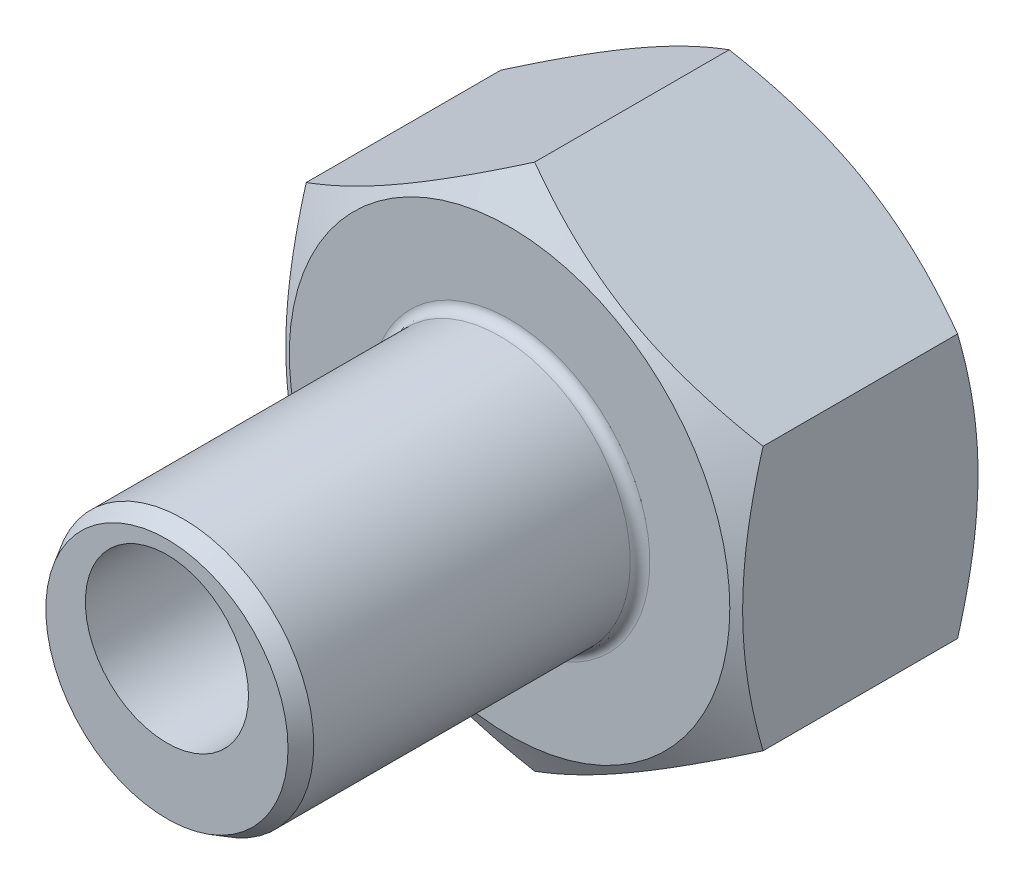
ISO-10303-21;
HEADER;
FILE_DESCRIPTION(('STEP AP214'),'2;1');
FILE_NAME('part.step','',(''),(''),'','','');
FILE_SCHEMA(('AUTOMOTIVE_DESIGN { 1 0 10303 214 1 1 1 1 }'));
ENDSEC;
DATA;
#1=APPLICATION_CONTEXT('core data for automotive mechanical design processes');
#2=APPLICATION_PROTOCOL_DEFINITION('international standard','automotive_design',2000,#1);
#3=PRODUCT_CONTEXT('',#1,'mechanical');
#4=PRODUCT('Part','Part','',(#3));
#5=PRODUCT_RELATED_PRODUCT_CATEGORY('part','',(#4));
#6=PRODUCT_DEFINITION_FORMATION('','',#4);
#7=PRODUCT_DEFINITION_CONTEXT('part definition',#1,'design');
#8=PRODUCT_DEFINITION('design','',#6,#7);
#9=PRODUCT_DEFINITION_SHAPE('','',#8);
#10=(LENGTH_UNIT() NAMED_UNIT(*) SI_UNIT(.MILLI.,.METRE.));
#11=(NAMED_UNIT(*) PLANE_ANGLE_UNIT() SI_UNIT($,.RADIAN.));
#12=(NAMED_UNIT(*) SI_UNIT($,.STERADIAN.) SOLID_ANGLE_UNIT());
#13=UNCERTAINTY_MEASURE_WITH_UNIT(LENGTH_MEASURE(1.E-05),#10,'distance_accuracy_value','');
#14=(GEOMETRIC_REPRESENTATION_CONTEXT(3) GLOBAL_UNCERTAINTY_ASSIGNED_CONTEXT((#13)) GLOBAL_UNIT_ASSIGNED_CONTEXT((#10,
#11,#12)) REPRESENTATION_CONTEXT('',''));
#15=CARTESIAN_POINT('',(0.,0.,0.));
#16=DIRECTION('',(0.,0.,1.));
#17=DIRECTION('',(1.,0.,0.));
#18=AXIS2_PLACEMENT_3D('',#15,#16,#17);
#19=CARTESIAN_POINT('',(-7.,3.2414518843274,7.5));
#20=DIRECTION('',(-0.5,0.866025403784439,0.));
#21=DIRECTION('',(0.866025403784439,0.5,0.));
#22=AXIS2_PLACEMENT_3D('',#19,#20,#21);
#23=PLANE('',#22);
#24=DIRECTION('',(0.,0.,-1.));
#25=VECTOR('',#24,1.);
#26=CARTESIAN_POINT('',(0.,7.28290376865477,7.5));
#27=LINE('',#26,#25);
#28=CARTESIAN_POINT('',(0.,7.28290376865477,6.73044765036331));
#29=VERTEX_POINT('',#28);
#30=CARTESIAN_POINT('',(0.,7.28290376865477,0.769552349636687));
#31=VERTEX_POINT('',#30);
#32=EDGE_CURVE('E87',#29,#31,#27,.T.);
#33=ORIENTED_EDGE('',*,*,#32,.T.);
#34=CARTESIAN_POINT('',(0.000199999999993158,7.28301923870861,0.769619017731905));
#35=CARTESIAN_POINT('',(-0.153667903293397,7.19418356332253,0.718337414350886));
#36=CARTESIAN_POINT('',(-0.308109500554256,7.10501666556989,0.669383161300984));
#37=CARTESIAN_POINT('',(-0.61824692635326,6.92595873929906,0.576770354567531));
#38=CARTESIAN_POINT('',(-0.773943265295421,6.83606741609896,0.533114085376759));
#39=CARTESIAN_POINT('',(-1.24352516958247,6.56495417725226,0.410949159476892));
#40=CARTESIAN_POINT('',(-1.55926433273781,6.38266208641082,0.341463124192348));
#41=CARTESIAN_POINT('',(-2.03176224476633,6.10986528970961,0.259982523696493));
#42=CARTESIAN_POINT('',(-2.18710922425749,6.0201756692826,0.23677105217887));
#43=CARTESIAN_POINT('',(-2.49850511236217,5.84039116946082,0.197848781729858));
#44=CARTESIAN_POINT('',(-2.65455395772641,5.75029632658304,0.182137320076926));
#45=CARTESIAN_POINT('',(-2.96692267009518,5.56995016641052,0.158615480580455));
#46=CARTESIAN_POINT('',(-3.12324202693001,5.47969914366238,0.150796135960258));
#47=CARTESIAN_POINT('',(-3.43601650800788,5.29911871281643,0.143217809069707));
#48=CARTESIAN_POINT('',(-3.59247162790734,5.20878930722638,0.143458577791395));
#49=CARTESIAN_POINT('',(-4.02110687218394,4.96131663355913,0.155197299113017));
#50=CARTESIAN_POINT('',(-4.29314668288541,4.80425437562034,0.174903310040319));
#51=CARTESIAN_POINT('',(-4.8354194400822,4.49117305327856,0.237391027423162));
#52=CARTESIAN_POINT('',(-5.10565047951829,4.33515508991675,0.280194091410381));
#53=CARTESIAN_POINT('',(-5.64901454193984,4.0214437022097,0.387189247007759));
#54=CARTESIAN_POINT('',(-5.92207900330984,3.86378986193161,0.451834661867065));
#55=CARTESIAN_POINT('',(-6.46413578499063,3.55083323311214,0.598553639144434));
#56=CARTESIAN_POINT('',(-6.73313504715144,3.39552643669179,0.68059273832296));
#57=CARTESIAN_POINT('',(-7.0002,3.24133641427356,0.769619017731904));
#58=B_SPLINE_CURVE_WITH_KNOTS('',3,(#34,#35,#36,#37,#38,#39,#40,#41,#42,#43,#44,#45,#46,#47,#48,
#49,#50,#51,#52,#53,#54,#55,#56,#57),.UNSPECIFIED.,.F.,.F.,(4,2,2,2,2,2,2,2,2,2,2,4),(0.,
0.554727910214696,1.10969417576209,2.2219327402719,2.76443041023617,3.30688013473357,
3.8487128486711,4.39052882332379,5.33376515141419,6.27787517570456,7.2429241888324,
8.20607866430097),.UNSPECIFIED.);
#59=CARTESIAN_POINT('',(-7.,3.2414518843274,0.769552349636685));
#60=VERTEX_POINT('',#59);
#61=EDGE_CURVE('E29',#31,#60,#58,.T.);
#62=ORIENTED_EDGE('',*,*,#61,.T.);
#63=DIRECTION('',(0.,0.,-1.));
#64=VECTOR('',#63,1.);
#65=CARTESIAN_POINT('',(-7.,3.2414518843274,7.5));
#66=LINE('',#65,#64);
#67=CARTESIAN_POINT('',(-7.,3.2414518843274,6.73044765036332));
#68=VERTEX_POINT('',#67);
#69=EDGE_CURVE('E103',#68,#60,#66,.T.);
#70=ORIENTED_EDGE('',*,*,#69,.F.);
#71=CARTESIAN_POINT('',(-7.0002,3.24133641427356,6.7303809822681));
#72=CARTESIAN_POINT('',(-6.84633209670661,3.33017208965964,6.78166258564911));
#73=CARTESIAN_POINT('',(-6.69189049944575,3.41933898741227,6.830616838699));
#74=CARTESIAN_POINT('',(-6.38175307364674,3.59839691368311,6.92322964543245));
#75=CARTESIAN_POINT('',(-6.22605673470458,3.6882882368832,6.96688591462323));
#76=CARTESIAN_POINT('',(-5.75647483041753,3.95940147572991,7.08905084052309));
#77=CARTESIAN_POINT('',(-5.4407356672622,4.14169356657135,7.15853687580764));
#78=CARTESIAN_POINT('',(-4.96823775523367,4.41449036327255,7.24001747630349));
#79=CARTESIAN_POINT('',(-4.81289077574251,4.50417998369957,7.26322894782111));
#80=CARTESIAN_POINT('',(-4.50149488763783,4.68396448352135,7.30215121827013));
#81=CARTESIAN_POINT('',(-4.34544604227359,4.77405932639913,7.31786267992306));
#82=CARTESIAN_POINT('',(-4.03307732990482,4.95440548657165,7.34138451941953));
#83=CARTESIAN_POINT('',(-3.87675797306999,5.04465650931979,7.34920386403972));
#84=CARTESIAN_POINT('',(-3.56398349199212,5.22523694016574,7.35678219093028));
#85=CARTESIAN_POINT('',(-3.40752837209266,5.31556634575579,7.3565414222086));
#86=CARTESIAN_POINT('',(-2.97889312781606,5.56303901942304,7.34480270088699));
#87=CARTESIAN_POINT('',(-2.7068533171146,5.72010127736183,7.32509668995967));
#88=CARTESIAN_POINT('',(-2.16458055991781,6.0331825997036,7.26260897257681));
#89=CARTESIAN_POINT('',(-1.89434952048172,6.18920056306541,7.2198059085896));
#90=CARTESIAN_POINT('',(-1.35098545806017,6.50291195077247,7.11281075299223));
#91=CARTESIAN_POINT('',(-1.07792099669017,6.66056579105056,7.04816533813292));
#92=CARTESIAN_POINT('',(-0.535864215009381,6.97352241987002,6.90144636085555));
#93=CARTESIAN_POINT('',(-0.26686495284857,7.12882921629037,6.81940726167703));
#94=CARTESIAN_POINT('',(0.000199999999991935,7.2830192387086,6.7303809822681));
#95=B_SPLINE_CURVE_WITH_KNOTS('',3,(#71,#72,#73,#74,#75,#76,#77,#78,#79,#80,#81,#82,#83,#84,#85,
#86,#87,#88,#89,#90,#91,#92,#93,#94),.UNSPECIFIED.,.F.,.F.,(4,2,2,2,2,2,2,2,2,2,2,4),(0.,
0.554727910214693,1.10969417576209,2.2219327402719,2.76443041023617,3.30688013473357,
3.8487128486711,4.39052882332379,5.33376515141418,6.27787517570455,7.24292418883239,
8.20607866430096),.UNSPECIFIED.);
#96=EDGE_CURVE('E151',#68,#29,#95,.T.);
#97=ORIENTED_EDGE('',*,*,#96,.T.);
#98=EDGE_LOOP('',(#33,#62,#70,#97));
#99=FACE_BOUND('',#98,.T.);
#100=ADVANCED_FACE('F14',(#99),#23,.T.);
#101=CARTESIAN_POINT('',(-7.,-4.84145188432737,7.5));
#102=DIRECTION('',(-1.,0.,0.));
#103=DIRECTION('',(0.,1.,0.));
#104=AXIS2_PLACEMENT_3D('',#101,#102,#103);
#105=PLANE('',#104);
#106=ORIENTED_EDGE('',*,*,#69,.T.);
#107=CARTESIAN_POINT('',(-7.,-11.6861591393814,3.5752449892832));
#108=CARTESIAN_POINT('',(-7.,-11.3801667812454,3.42668958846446));
#109=CARTESIAN_POINT('',(-7.,-11.0734752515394,3.27954984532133));
#110=CARTESIAN_POINT('',(-7.,-10.4583221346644,2.98889726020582));
#111=CARTESIAN_POINT('',(-7.,-10.1498602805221,2.84538498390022));
#112=CARTESIAN_POINT('',(-7.,-9.52922004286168,2.56206740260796));
#113=CARTESIAN_POINT('',(-7.,-9.21703058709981,2.42228626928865));
#114=CARTESIAN_POINT('',(-7.,-8.59017927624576,2.14840390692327));
#115=CARTESIAN_POINT('',(-7.,-8.2755175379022,2.01430241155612));
#116=CARTESIAN_POINT('',(-7.,-7.63294917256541,1.74903741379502));
#117=CARTESIAN_POINT('',(-7.,-7.30494424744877,1.61811071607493));
#118=CARTESIAN_POINT('',(-7.,-6.64510897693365,1.36609304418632));
#119=CARTESIAN_POINT('',(-7.,-6.31327820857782,1.24500316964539));
#120=CARTESIAN_POINT('',(-7.,-5.64587063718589,1.01581609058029));
#121=CARTESIAN_POINT('',(-7.,-5.31030287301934,0.907692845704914));
#122=CARTESIAN_POINT('',(-7.,-4.63436573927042,0.707887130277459));
#123=CARTESIAN_POINT('',(-7.,-4.29399790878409,0.616199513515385));
#124=CARTESIAN_POINT('',(-7.,-3.61010581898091,0.454140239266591));
#125=CARTESIAN_POINT('',(-7.,-3.26660997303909,0.383651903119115));
#126=CARTESIAN_POINT('',(-7.,-2.74821364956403,0.296854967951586));
#127=CARTESIAN_POINT('',(-7.,-2.57487675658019,0.271077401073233));
#128=CARTESIAN_POINT('',(-7.,-2.22733190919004,0.226339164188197));
#129=CARTESIAN_POINT('',(-7.,-2.05312404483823,0.207377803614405));
#130=CARTESIAN_POINT('',(-7.,-1.70635877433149,0.176888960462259));
#131=CARTESIAN_POINT('',(-7.,-1.53380968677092,0.165267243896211));
#132=CARTESIAN_POINT('',(-7.,-1.18837459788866,0.14933259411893));
#133=CARTESIAN_POINT('',(-7.,-1.01548860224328,0.145019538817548));
#134=CARTESIAN_POINT('',(-7.,-0.669688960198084,0.143805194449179));
#135=CARTESIAN_POINT('',(-7.,-0.496775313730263,0.146903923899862));
#136=CARTESIAN_POINT('',(-7.,-0.151233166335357,0.1604369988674));
#137=CARTESIAN_POINT('',(-7.,0.0213953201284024,0.170871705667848));
#138=CARTESIAN_POINT('',(-7.,0.435352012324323,0.204468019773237));
#139=CARTESIAN_POINT('',(-7.,0.676407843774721,0.231059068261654));
#140=CARTESIAN_POINT('',(-7.,1.15673899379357,0.297101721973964));
#141=CARTESIAN_POINT('',(-7.,1.39601406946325,0.336555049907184));
#142=CARTESIAN_POINT('',(-7.,2.11088953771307,0.472117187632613));
#143=CARTESIAN_POINT('',(-7.,2.58327606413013,0.58540386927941));
#144=CARTESIAN_POINT('',(-7.,3.28966663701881,0.781970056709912));
#145=CARTESIAN_POINT('',(-7.,3.52733145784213,0.852851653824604));
#146=CARTESIAN_POINT('',(-7.,4.00035299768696,1.00200643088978));
#147=CARTESIAN_POINT('',(-7.,4.23570970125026,1.08027966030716));
#148=CARTESIAN_POINT('',(-6.99999999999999,4.70418852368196,1.24295934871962));
#149=CARTESIAN_POINT('',(-6.99999999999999,4.93731134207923,1.32736381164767));
#150=CARTESIAN_POINT('',(-7.,5.40162339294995,1.5013098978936));
#151=CARTESIAN_POINT('',(-7.,5.63281264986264,1.59085145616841));
#152=CARTESIAN_POINT('',(-7.,6.18545924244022,1.81083483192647));
#153=CARTESIAN_POINT('',(-7.,6.50609746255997,1.94333084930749));
#154=CARTESIAN_POINT('',(-6.99999999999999,7.14458783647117,2.21489357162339));
#155=CARTESIAN_POINT('',(-6.99999999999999,7.46243980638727,2.35396070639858));
#156=CARTESIAN_POINT('',(-6.99999999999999,8.0958881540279,2.6373261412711));
#157=CARTESIAN_POINT('',(-6.99999999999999,8.41148397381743,2.78162568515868));
#158=CARTESIAN_POINT('',(-6.99999999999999,9.04072810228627,3.0743811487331));
#159=CARTESIAN_POINT('',(-6.99999999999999,9.35437645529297,3.22283697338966));
#160=CARTESIAN_POINT('',(-6.99999999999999,9.98041377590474,3.52328562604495));
#161=CARTESIAN_POINT('',(-6.99999999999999,10.2928008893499,3.67528231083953));
#162=CARTESIAN_POINT('',(-6.99999999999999,10.9162162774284,3.98203983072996));
#163=CARTESIAN_POINT('',(-6.99999999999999,11.2272445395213,4.13680069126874));
#164=CARTESIAN_POINT('',(-6.99999999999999,12.1585328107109,4.60443898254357));
#165=CARTESIAN_POINT('',(-6.99999999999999,12.7770857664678,4.92071542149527));
#166=CARTESIAN_POINT('',(-6.99999999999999,13.957816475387,5.53212013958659));
#167=CARTESIAN_POINT('',(-6.99999999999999,14.5202656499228,5.82672663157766));
#168=CARTESIAN_POINT('',(-6.99999999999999,15.643085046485,6.41992335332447));
#169=CARTESIAN_POINT('',(-6.99999999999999,16.2034551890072,6.71851373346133));
#170=CARTESIAN_POINT('',(-6.99999999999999,17.321124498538,7.31794015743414));
#171=CARTESIAN_POINT('',(-6.99999999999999,17.8784278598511,7.61876839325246));
#172=CARTESIAN_POINT('',(-6.99999999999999,18.9917097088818,8.22279140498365));
#173=CARTESIAN_POINT('',(-6.99999999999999,19.5476882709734,8.52598604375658));
#174=CARTESIAN_POINT('',(-7.,20.1031815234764,8.83006130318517));
#175=B_SPLINE_CURVE_WITH_KNOTS('',3,(#107,#108,#109,#110,#111,#112,#113,#114,#115,#116,#117,
#118,#119,#120,#121,#122,#123,#124,#125,#126,#127,#128,#129,#130,#131,#132,#133,#134,#135,#136,
#137,#138,#139,#140,#141,#142,#143,#144,#145,#146,#147,#148,#149,#150,#151,#152,#153,#154,#155,
#156,#157,#158,#159,#160,#161,#162,#163,#164,#165,#166,#167,#168,#169,#170,#171,#172,#173,#174),
.UNSPECIFIED.,.F.,.F.,(4,2,2,2,2,2,2,2,2,2,2,2,2,2,2,2,2,2,2,2,2,2,2,2,2,2,2,2,2,2,2,2,2,4),(0.,
1.02045352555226,2.04106521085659,3.06718221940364,4.09325105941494,5.15263853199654,
6.2121442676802,7.26948528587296,8.32649465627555,9.37757515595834,9.90319169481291,
10.4287549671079,10.9474254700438,11.4660873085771,11.9847504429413,12.5034391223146,
13.2305829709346,13.9578242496,15.4130988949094,16.1570651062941,16.9010362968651,
17.6447663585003,18.3884870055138,19.4291928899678,20.4699669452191,21.5109900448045,
22.5519893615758,23.5941811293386,24.6363824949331,26.7204870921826,28.6252742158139,
30.5301334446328,32.4300647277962,34.3298867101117),.UNSPECIFIED.);
#176=CARTESIAN_POINT('',(-7.,-4.84145188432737,0.76955234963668));
#177=VERTEX_POINT('',#176);
#178=EDGE_CURVE('E168',#60,#177,#175,.F.);
#179=ORIENTED_EDGE('',*,*,#178,.T.);
#180=DIRECTION('',(0.,0.,-1.));
#181=VECTOR('',#180,1.);
#182=CARTESIAN_POINT('',(-7.,-4.84145188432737,7.5));
#183=LINE('',#182,#181);
#184=CARTESIAN_POINT('',(-7.,-4.84145188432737,6.73044765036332));
#185=VERTEX_POINT('',#184);
#186=EDGE_CURVE('E225',#185,#177,#183,.T.);
#187=ORIENTED_EDGE('',*,*,#186,.F.);
#188=CARTESIAN_POINT('',(-7.,-11.8030397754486,3.86790709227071));
#189=CARTESIAN_POINT('',(-7.,-11.4960361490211,4.01741728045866));
#190=CARTESIAN_POINT('',(-7.,-11.1883433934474,4.165535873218));
#191=CARTESIAN_POINT('',(-7.,-10.5712136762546,4.45821004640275));
#192=CARTESIAN_POINT('',(-7.,-10.2617764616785,4.60276509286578));
#193=CARTESIAN_POINT('',(-7.,-9.63926703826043,4.8882284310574));
#194=CARTESIAN_POINT('',(-7.,-9.32618429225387,5.02911382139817));
#195=CARTESIAN_POINT('',(-7.,-8.69757967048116,5.30531247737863));
#196=CARTESIAN_POINT('',(-7.,-8.38205790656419,5.44062599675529));
#197=CARTESIAN_POINT('',(-7.,-7.73734254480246,5.70867624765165));
#198=CARTESIAN_POINT('',(-7.,-7.4080476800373,5.8411707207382));
#199=CARTESIAN_POINT('',(-7.,-6.74566094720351,6.0964838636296));
#200=CARTESIAN_POINT('',(-7.,-6.4125686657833,6.219301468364));
#201=CARTESIAN_POINT('',(-7.,-5.74263042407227,6.45214382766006));
#202=CARTESIAN_POINT('',(-7.,-5.40579313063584,6.56219325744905));
#203=CARTESIAN_POINT('',(-7.,-4.72730047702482,6.76606674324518));
#204=CARTESIAN_POINT('',(-7.,-4.38564662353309,6.85989575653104));
#205=CARTESIAN_POINT('',(-7.,-3.69919481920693,7.02641200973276));
#206=CARTESIAN_POINT('',(-7.,-3.35442672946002,7.09921908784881));
#207=CARTESIAN_POINT('',(-7.,-2.83402007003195,7.1895884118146));
#208=CARTESIAN_POINT('',(-7.,-2.65999685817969,7.21657249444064));
#209=CARTESIAN_POINT('',(-7.,-2.31103714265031,7.26373467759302));
#210=CARTESIAN_POINT('',(-7.,-2.13610073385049,7.28391347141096));
#211=CARTESIAN_POINT('',(-7.,-1.78789728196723,7.31680225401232));
#212=CARTESIAN_POINT('',(-7.,-1.61463941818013,7.32960901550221));
#213=CARTESIAN_POINT('',(-7.,-1.26773686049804,7.34787788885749));
#214=CARTESIAN_POINT('',(-7.,-1.09409217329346,7.353340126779));
#215=CARTESIAN_POINT('',(-7.,-0.746727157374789,7.3567890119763));
#216=CARTESIAN_POINT('',(-7.,-0.573006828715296,7.35477566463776));
#217=CARTESIAN_POINT('',(-7.,-0.225809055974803,7.3433243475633));
#218=CARTESIAN_POINT('',(-7.,-0.0523316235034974,7.3338860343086));
#219=CARTESIAN_POINT('',(-7.,0.360197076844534,7.30281665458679));
#220=CARTESIAN_POINT('',(-7.,0.599007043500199,7.27790702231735));
#221=CARTESIAN_POINT('',(-7.,1.07493883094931,7.21534332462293));
#222=CARTESIAN_POINT('',(-7.,1.31206043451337,7.17768764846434));
#223=CARTESIAN_POINT('',(-7.,2.02057355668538,7.04759116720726));
#224=CARTESIAN_POINT('',(-7.,2.48886993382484,6.9380417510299));
#225=CARTESIAN_POINT('',(-7.,3.18932219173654,6.74698987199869));
#226=CARTESIAN_POINT('',(-7.,3.42508139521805,6.67792874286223));
#227=CARTESIAN_POINT('',(-7.,3.89431286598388,6.53236204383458));
#228=CARTESIAN_POINT('',(-7.,4.1277851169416,6.45585642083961));
#229=CARTESIAN_POINT('',(-6.99999999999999,4.59251128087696,6.29665062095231));
#230=CARTESIAN_POINT('',(-6.99999999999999,4.82376582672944,6.21395227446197));
#231=CARTESIAN_POINT('',(-7.,5.28434047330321,6.04336104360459));
#232=CARTESIAN_POINT('',(-7.,5.51366060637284,5.95546824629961));
#233=CARTESIAN_POINT('',(-7.,6.08987625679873,5.72831937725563));
#234=CARTESIAN_POINT('',(-7.,6.43564399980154,5.58620638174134));
#235=CARTESIAN_POINT('',(-6.99999999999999,7.12392059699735,5.29427111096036));
#236=CARTESIAN_POINT('',(-6.99999999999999,7.4664291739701,5.14444818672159));
#237=CARTESIAN_POINT('',(-6.99999999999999,8.1488586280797,4.83876781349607));
#238=CARTESIAN_POINT('',(-6.99999999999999,8.48877869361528,4.68290855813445));
#239=CARTESIAN_POINT('',(-6.99999999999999,9.16640030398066,4.36647961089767));
#240=CARTESIAN_POINT('',(-6.99999999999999,9.50410191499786,4.20591006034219));
#241=CARTESIAN_POINT('',(-6.99999999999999,10.1781457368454,3.88079141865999));
#242=CARTESIAN_POINT('',(-6.99999999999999,10.5144854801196,3.71623722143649));
#243=CARTESIAN_POINT('',(-6.99999999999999,11.1856558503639,3.38407979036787));
#244=CARTESIAN_POINT('',(-6.99999999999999,11.5204864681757,3.21647653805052));
#245=CARTESIAN_POINT('',(-6.99999999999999,12.5229880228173,2.71002111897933));
#246=CARTESIAN_POINT('',(-6.99999999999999,13.1887874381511,2.36746547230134));
#247=CARTESIAN_POINT('',(-6.99999999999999,14.4542149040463,1.70821312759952));
#248=CARTESIAN_POINT('',(-6.99999999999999,15.054161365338,1.39212471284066));
#249=CARTESIAN_POINT('',(-6.99999999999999,16.2518914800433,0.75581035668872));
#250=CARTESIAN_POINT('',(-6.99999999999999,16.8496750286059,0.435584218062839));
#251=CARTESIAN_POINT('',(-6.99999999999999,18.0417931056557,-0.207017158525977));
#252=CARTESIAN_POINT('',(-6.99999999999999,18.6361326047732,-0.529383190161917));
#253=CARTESIAN_POINT('',(-6.99999999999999,19.8234476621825,-1.17652403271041));
#254=CARTESIAN_POINT('',(-6.99999999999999,20.4164233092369,-1.50129868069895));
#255=CARTESIAN_POINT('',(-7.,21.0089080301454,-1.82696056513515));
#256=B_SPLINE_CURVE_WITH_KNOTS('',3,(#188,#189,#190,#191,#192,#193,#194,#195,#196,#197,#198,
#199,#200,#201,#202,#203,#204,#205,#206,#207,#208,#209,#210,#211,#212,#213,#214,#215,#216,#217,
#218,#219,#220,#221,#222,#223,#224,#225,#226,#227,#228,#229,#230,#231,#232,#233,#234,#235,#236,
#237,#238,#239,#240,#241,#242,#243,#244,#245,#246,#247,#248,#249,#250,#251,#252,#253,#254,#255),
.UNSPECIFIED.,.F.,.F.,(4,2,2,2,2,2,2,2,2,2,2,2,2,2,2,2,2,2,2,2,2,2,2,2,2,2,2,2,2,2,2,2,2,4),(0.,
1.02443394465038,2.04902046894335,3.07894071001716,4.10881399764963,5.1735475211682,
6.23839806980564,7.30115519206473,8.36358693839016,9.41983685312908,9.94803341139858,
10.4761761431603,10.9972178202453,11.5182505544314,12.0392829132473,12.5603393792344,
13.2802523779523,14.0002563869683,15.4409941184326,16.1779269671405,16.9148650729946,
17.6515862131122,18.3882950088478,19.5096628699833,20.6311252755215,21.7529259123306,
22.874692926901,23.9979826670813,25.1212792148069,27.3674760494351,29.401821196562,
31.4362636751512,33.4646644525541,35.4929292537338),.UNSPECIFIED.);
#257=EDGE_CURVE('E144',#185,#68,#256,.T.);
#258=ORIENTED_EDGE('',*,*,#257,.T.);
#259=EDGE_LOOP('',(#106,#179,#187,#258));
#260=FACE_BOUND('',#259,.T.);
#261=ADVANCED_FACE('F157',(#260),#105,.T.);
#262=CARTESIAN_POINT('',(0.,-8.88290376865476,7.5));
#263=DIRECTION('',(-0.5,-0.866025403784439,0.));
#264=DIRECTION('',(-0.866025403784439,0.5,0.));
#265=AXIS2_PLACEMENT_3D('',#262,#263,#264);
#266=PLANE('',#265);
#267=ORIENTED_EDGE('',*,*,#186,.T.);
#268=CARTESIAN_POINT('',(-7.0002,-4.84133641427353,0.769619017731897));
#269=CARTESIAN_POINT('',(-6.84633209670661,-4.93017208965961,0.718337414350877));
#270=CARTESIAN_POINT('',(-6.69189049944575,-5.01933898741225,0.669383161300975));
#271=CARTESIAN_POINT('',(-6.38175307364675,-5.19839691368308,0.576770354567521));
#272=CARTESIAN_POINT('',(-6.22605673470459,-5.28828823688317,0.533114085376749));
#273=CARTESIAN_POINT('',(-5.75647483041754,-5.55940147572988,0.410949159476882));
#274=CARTESIAN_POINT('',(-5.4407356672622,-5.74169356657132,0.341463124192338));
#275=CARTESIAN_POINT('',(-4.96823775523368,-6.01449036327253,0.259982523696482));
#276=CARTESIAN_POINT('',(-4.81289077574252,-6.10417998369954,0.236771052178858));
#277=CARTESIAN_POINT('',(-4.50149488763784,-6.28396448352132,0.197848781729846));
#278=CARTESIAN_POINT('',(-4.3454460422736,-6.37405932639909,0.182137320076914));
#279=CARTESIAN_POINT('',(-4.03307732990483,-6.55440548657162,0.158615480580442));
#280=CARTESIAN_POINT('',(-3.87675797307,-6.64465650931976,0.150796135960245));
#281=CARTESIAN_POINT('',(-3.56398349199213,-6.82523694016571,0.143217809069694));
#282=CARTESIAN_POINT('',(-3.40752837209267,-6.91556634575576,0.143458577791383));
#283=CARTESIAN_POINT('',(-2.97889312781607,-7.16303901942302,0.155197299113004));
#284=CARTESIAN_POINT('',(-2.7068533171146,-7.3201012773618,0.174903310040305));
#285=CARTESIAN_POINT('',(-2.1645805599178,-7.63318259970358,0.237391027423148));
#286=CARTESIAN_POINT('',(-1.89434952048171,-7.78920056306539,0.280194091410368));
#287=CARTESIAN_POINT('',(-1.35098545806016,-8.10291195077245,0.387189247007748));
#288=CARTESIAN_POINT('',(-1.07792099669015,-8.26056579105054,0.451834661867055));
#289=CARTESIAN_POINT('',(-0.535864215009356,-8.57352241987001,0.598553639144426));
#290=CARTESIAN_POINT('',(-0.266864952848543,-8.72882921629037,0.680592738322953));
#291=CARTESIAN_POINT('',(0.00020000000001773,-8.8830192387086,0.769619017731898));
#292=B_SPLINE_CURVE_WITH_KNOTS('',3,(#268,#269,#270,#271,#272,#273,#274,#275,#276,#277,#278,
#279,#280,#281,#282,#283,#284,#285,#286,#287,#288,#289,#290,#291),.UNSPECIFIED.,.F.,.F.,(4,2,2,
2,2,2,2,2,2,2,2,4),(0.,0.554727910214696,1.10969417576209,2.2219327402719,2.76443041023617,
3.30688013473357,3.84871284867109,4.39052882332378,5.33376515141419,6.27787517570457,
7.24292418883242,8.206078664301),.UNSPECIFIED.);
#293=CARTESIAN_POINT('',(0.,-8.88290376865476,0.769552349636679));
#294=VERTEX_POINT('',#293);
#295=EDGE_CURVE('E176',#177,#294,#292,.T.);
#296=ORIENTED_EDGE('',*,*,#295,.T.);
#297=DIRECTION('',(0.,0.,-1.));
#298=VECTOR('',#297,1.);
#299=CARTESIAN_POINT('',(0.,-8.88290376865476,7.5));
#300=LINE('',#299,#298);
#301=CARTESIAN_POINT('',(0.,-8.88290376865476,6.73044765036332));
#302=VERTEX_POINT('',#301);
#303=EDGE_CURVE('E89',#302,#294,#300,.T.);
#304=ORIENTED_EDGE('',*,*,#303,.F.);
#305=CARTESIAN_POINT('',(0.000200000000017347,-8.8830192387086,6.7303809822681));
#306=CARTESIAN_POINT('',(-0.153667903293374,-8.79418356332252,6.78166258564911));
#307=CARTESIAN_POINT('',(-0.308109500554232,-8.70501666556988,6.83061683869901));
#308=CARTESIAN_POINT('',(-0.618246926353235,-8.52595873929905,6.92322964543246));
#309=CARTESIAN_POINT('',(-0.773943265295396,-8.43606741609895,6.96688591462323));
#310=CARTESIAN_POINT('',(-1.24352516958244,-8.16495417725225,7.0890508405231));
#311=CARTESIAN_POINT('',(-1.55926433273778,-7.98266208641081,7.15853687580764));
#312=CARTESIAN_POINT('',(-2.03176224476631,-7.7098652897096,7.2400174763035));
#313=CARTESIAN_POINT('',(-2.18710922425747,-7.62017566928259,7.26322894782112));
#314=CARTESIAN_POINT('',(-2.49850511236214,-7.44039116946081,7.30215121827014));
#315=CARTESIAN_POINT('',(-2.65455395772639,-7.35029632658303,7.31786267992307));
#316=CARTESIAN_POINT('',(-2.96692267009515,-7.16995016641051,7.34138451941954));
#317=CARTESIAN_POINT('',(-3.12324202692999,-7.07969914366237,7.34920386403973));
#318=CARTESIAN_POINT('',(-3.43601650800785,-6.89911871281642,7.35678219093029));
#319=CARTESIAN_POINT('',(-3.59247162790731,-6.80878930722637,7.35654142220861));
#320=CARTESIAN_POINT('',(-4.02110687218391,-6.56131663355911,7.344802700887));
#321=CARTESIAN_POINT('',(-4.29314668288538,-6.40425437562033,7.32509668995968));
#322=CARTESIAN_POINT('',(-4.83541944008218,-6.09117305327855,7.26260897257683));
#323=CARTESIAN_POINT('',(-5.10565047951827,-5.93515508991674,7.21980590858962));
#324=CARTESIAN_POINT('',(-5.64901454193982,-5.62144370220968,7.11281075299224));
#325=CARTESIAN_POINT('',(-5.92207900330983,-5.46378986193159,7.04816533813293));
#326=CARTESIAN_POINT('',(-6.46413578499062,-5.15083323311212,6.90144636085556));
#327=CARTESIAN_POINT('',(-6.73313504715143,-4.99552643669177,6.81940726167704));
#328=CARTESIAN_POINT('',(-7.0002,-4.84133641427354,6.7303809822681));
#329=B_SPLINE_CURVE_WITH_KNOTS('',3,(#305,#306,#307,#308,#309,#310,#311,#312,#313,#314,#315,
#316,#317,#318,#319,#320,#321,#322,#323,#324,#325,#326,#327,#328),.UNSPECIFIED.,.F.,.F.,(4,2,2,
2,2,2,2,2,2,2,2,4),(0.,0.554727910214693,1.10969417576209,2.2219327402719,2.76443041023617,
3.30688013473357,3.84871284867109,4.39052882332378,5.33376515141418,6.27787517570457,
7.24292418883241,8.20607866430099),.UNSPECIFIED.);
#330=EDGE_CURVE('E137',#302,#185,#329,.T.);
#331=ORIENTED_EDGE('',*,*,#330,.T.);
#332=EDGE_LOOP('',(#267,#296,#304,#331));
#333=FACE_BOUND('',#332,.T.);
#334=ADVANCED_FACE('F161',(#333),#266,.T.);
#335=CARTESIAN_POINT('',(7.,-4.84145188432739,7.5));
#336=DIRECTION('',(0.5,-0.866025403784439,0.));
#337=DIRECTION('',(-0.866025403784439,-0.5,0.));
#338=AXIS2_PLACEMENT_3D('',#335,#336,#337);
#339=PLANE('',#338);
#340=ORIENTED_EDGE('',*,*,#303,.T.);
#341=CARTESIAN_POINT('',(-0.000199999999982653,-8.88301923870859,0.769619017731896));
#342=CARTESIAN_POINT('',(0.15366790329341,-8.79418356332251,0.718337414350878));
#343=CARTESIAN_POINT('',(0.308109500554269,-8.70501666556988,0.669383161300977));
#344=CARTESIAN_POINT('',(0.618246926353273,-8.52595873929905,0.576770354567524));
#345=CARTESIAN_POINT('',(0.773943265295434,-8.43606741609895,0.533114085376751));
#346=CARTESIAN_POINT('',(1.24352516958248,-8.16495417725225,0.410949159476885));
#347=CARTESIAN_POINT('',(1.55926433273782,-7.98266208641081,0.341463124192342));
#348=CARTESIAN_POINT('',(2.03176224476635,-7.7098652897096,0.259982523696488));
#349=CARTESIAN_POINT('',(2.1871092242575,-7.62017566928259,0.236771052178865));
#350=CARTESIAN_POINT('',(2.49850511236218,-7.44039116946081,0.197848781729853));
#351=CARTESIAN_POINT('',(2.65455395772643,-7.35029632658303,0.182137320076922));
#352=CARTESIAN_POINT('',(2.96692267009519,-7.16995016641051,0.158615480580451));
#353=CARTESIAN_POINT('',(3.12324202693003,-7.07969914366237,0.150796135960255));
#354=CARTESIAN_POINT('',(3.43601650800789,-6.89911871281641,0.143217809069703));
#355=CARTESIAN_POINT('',(3.59247162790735,-6.80878930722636,0.143458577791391));
#356=CARTESIAN_POINT('',(4.02110687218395,-6.5613166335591,0.155197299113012));
#357=CARTESIAN_POINT('',(4.29314668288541,-6.40425437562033,0.174903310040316));
#358=CARTESIAN_POINT('',(4.83541944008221,-6.09117305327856,0.237391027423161));
#359=CARTESIAN_POINT('',(5.10565047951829,-5.93515508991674,0.280194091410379));
#360=CARTESIAN_POINT('',(5.64901454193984,-5.62144370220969,0.387189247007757));
#361=CARTESIAN_POINT('',(5.92207900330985,-5.4637898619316,0.451834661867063));
#362=CARTESIAN_POINT('',(6.46413578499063,-5.15083323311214,0.598553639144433));
#363=CARTESIAN_POINT('',(6.73313504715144,-4.99552643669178,0.680592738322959));
#364=CARTESIAN_POINT('',(7.0002,-4.84133641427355,0.769619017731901));
#365=B_SPLINE_CURVE_WITH_KNOTS('',3,(#341,#342,#343,#344,#345,#346,#347,#348,#349,#350,#351,
#352,#353,#354,#355,#356,#357,#358,#359,#360,#361,#362,#363,#364),.UNSPECIFIED.,.F.,.F.,(4,2,2,
2,2,2,2,2,2,2,2,4),(0.,0.554727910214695,1.10969417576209,2.2219327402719,2.76443041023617,
3.30688013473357,3.8487128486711,4.39052882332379,5.33376515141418,6.27787517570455,
7.24292418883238,8.20607866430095),.UNSPECIFIED.);
#366=CARTESIAN_POINT('',(7.,-4.84145188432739,0.769552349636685));
#367=VERTEX_POINT('',#366);
#368=EDGE_CURVE('E83',#294,#367,#365,.T.);
#369=ORIENTED_EDGE('',*,*,#368,.T.);
#370=DIRECTION('',(0.,0.,-1.));
#371=VECTOR('',#370,1.);
#372=CARTESIAN_POINT('',(7.,-4.84145188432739,7.5));
#373=LINE('',#372,#371);
#374=CARTESIAN_POINT('',(7.,-4.84145188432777,6.73044765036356));
#375=VERTEX_POINT('',#374);
#376=EDGE_CURVE('E82',#375,#367,#373,.T.);
#377=ORIENTED_EDGE('',*,*,#376,.F.);
#378=CARTESIAN_POINT('',(7.0002,-4.84133641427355,6.73038098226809));
#379=CARTESIAN_POINT('',(6.84633209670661,-4.93017208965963,6.7816625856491));
#380=CARTESIAN_POINT('',(6.69189049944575,-5.01933898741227,6.830616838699));
#381=CARTESIAN_POINT('',(6.38175307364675,-5.1983969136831,6.92322964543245));
#382=CARTESIAN_POINT('',(6.22605673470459,-5.28828823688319,6.96688591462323));
#383=CARTESIAN_POINT('',(5.75647483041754,-5.5594014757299,7.08905084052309));
#384=CARTESIAN_POINT('',(5.4407356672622,-5.74169356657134,7.15853687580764));
#385=CARTESIAN_POINT('',(4.96823775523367,-6.01449036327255,7.24001747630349));
#386=CARTESIAN_POINT('',(4.81289077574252,-6.10417998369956,7.26322894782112));
#387=CARTESIAN_POINT('',(4.50149488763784,-6.28396448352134,7.30215121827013));
#388=CARTESIAN_POINT('',(4.3454460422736,-6.37405932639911,7.31786267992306));
#389=CARTESIAN_POINT('',(4.03307732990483,-6.55440548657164,7.34138451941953));
#390=CARTESIAN_POINT('',(3.87675797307,-6.64465650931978,7.34920386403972));
#391=CARTESIAN_POINT('',(3.56398349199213,-6.82523694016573,7.35678219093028));
#392=CARTESIAN_POINT('',(3.40752837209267,-6.91556634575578,7.3565414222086));
#393=CARTESIAN_POINT('',(2.97889312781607,-7.16303901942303,7.34480270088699));
#394=CARTESIAN_POINT('',(2.70685331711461,-7.32010127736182,7.32509668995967));
#395=CARTESIAN_POINT('',(2.16458055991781,-7.63318259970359,7.26260897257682));
#396=CARTESIAN_POINT('',(1.89434952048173,-7.7892005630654,7.2198059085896));
#397=CARTESIAN_POINT('',(1.35098545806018,-8.10291195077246,7.11281075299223));
#398=CARTESIAN_POINT('',(1.07792099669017,-8.26056579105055,7.04816533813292));
#399=CARTESIAN_POINT('',(0.535864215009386,-8.57352241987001,6.90144636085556));
#400=CARTESIAN_POINT('',(0.266864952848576,-8.72882921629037,6.81940726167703));
#401=CARTESIAN_POINT('',(-0.000199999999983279,-8.8830192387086,6.7303809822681));
#402=B_SPLINE_CURVE_WITH_KNOTS('',3,(#378,#379,#380,#381,#382,#383,#384,#385,#386,#387,#388,
#389,#390,#391,#392,#393,#394,#395,#396,#397,#398,#399,#400,#401),.UNSPECIFIED.,.F.,.F.,(4,2,2,
2,2,2,2,2,2,2,2,4),(0.,0.554727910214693,1.10969417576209,2.22193274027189,2.76443041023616,
3.30688013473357,3.84871284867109,4.39052882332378,5.33376515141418,6.27787517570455,
7.24292418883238,8.20607866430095),.UNSPECIFIED.);
#403=EDGE_CURVE('E130',#375,#302,#402,.T.);
#404=ORIENTED_EDGE('',*,*,#403,.T.);
#405=EDGE_LOOP('',(#340,#369,#377,#404));
#406=FACE_BOUND('',#405,.T.);
#407=ADVANCED_FACE('F231',(#406),#339,.T.);
#408=CARTESIAN_POINT('',(7.,3.24145188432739,7.5));
#409=DIRECTION('',(1.,0.,0.));
#410=DIRECTION('',(0.,-1.,0.));
#411=AXIS2_PLACEMENT_3D('',#408,#409,#410);
#412=PLANE('',#411);
#413=ORIENTED_EDGE('',*,*,#376,.T.);
#414=CARTESIAN_POINT('',(7.,-11.6861591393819,3.57524498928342));
#415=CARTESIAN_POINT('',(7.,-11.3801667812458,3.42668958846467));
#416=CARTESIAN_POINT('',(7.00000000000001,-11.0734752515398,3.27954984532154));
#417=CARTESIAN_POINT('',(7.00000000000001,-10.4583221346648,2.98889726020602));
#418=CARTESIAN_POINT('',(7.00000000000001,-10.1498602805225,2.84538498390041));
#419=CARTESIAN_POINT('',(7.00000000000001,-9.52922004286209,2.56206740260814));
#420=CARTESIAN_POINT('',(7.00000000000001,-9.21703058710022,2.42228626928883));
#421=CARTESIAN_POINT('',(7.00000000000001,-8.59017927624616,2.14840390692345));
#422=CARTESIAN_POINT('',(7.00000000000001,-8.2755175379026,2.01430241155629));
#423=CARTESIAN_POINT('',(7.00000000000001,-7.6329491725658,1.74903741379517));
#424=CARTESIAN_POINT('',(7.,-7.30494424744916,1.61811071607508));
#425=CARTESIAN_POINT('',(7.,-6.64510897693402,1.36609304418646));
#426=CARTESIAN_POINT('',(7.,-6.31327820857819,1.24500316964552));
#427=CARTESIAN_POINT('',(7.,-5.64587063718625,1.01581609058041));
#428=CARTESIAN_POINT('',(7.,-5.31030287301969,0.907692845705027));
#429=CARTESIAN_POINT('',(7.,-4.63436573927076,0.707887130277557));
#430=CARTESIAN_POINT('',(7.,-4.29399790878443,0.616199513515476));
#431=CARTESIAN_POINT('',(7.,-3.61010581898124,0.454140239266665));
#432=CARTESIAN_POINT('',(7.,-3.26660997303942,0.383651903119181));
#433=CARTESIAN_POINT('',(7.,-2.74821364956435,0.296854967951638));
#434=CARTESIAN_POINT('',(7.,-2.57487675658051,0.27107740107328));
#435=CARTESIAN_POINT('',(7.,-2.22733190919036,0.226339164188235));
#436=CARTESIAN_POINT('',(7.,-2.05312404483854,0.207377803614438));
#437=CARTESIAN_POINT('',(7.,-1.70635877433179,0.176888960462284));
#438=CARTESIAN_POINT('',(7.,-1.53380968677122,0.165267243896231));
#439=CARTESIAN_POINT('',(7.,-1.18837459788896,0.149332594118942));
#440=CARTESIAN_POINT('',(7.,-1.01548860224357,0.145019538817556));
#441=CARTESIAN_POINT('',(7.,-0.669688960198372,0.143805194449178));
#442=CARTESIAN_POINT('',(7.,-0.496775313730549,0.146903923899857));
#443=CARTESIAN_POINT('',(7.,-0.151233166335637,0.160436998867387));
#444=CARTESIAN_POINT('',(7.,0.0213953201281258,0.170871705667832));
#445=CARTESIAN_POINT('',(7.,0.435352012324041,0.204468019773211));
#446=CARTESIAN_POINT('',(7.,0.67640784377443,0.231059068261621));
#447=CARTESIAN_POINT('',(7.,1.15673899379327,0.297101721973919));
#448=CARTESIAN_POINT('',(7.,1.39601406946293,0.336555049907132));
#449=CARTESIAN_POINT('',(7.,2.11088953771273,0.47211718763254));
#450=CARTESIAN_POINT('',(7.,2.58327606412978,0.585403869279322));
#451=CARTESIAN_POINT('',(7.,3.28966663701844,0.781970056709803));
#452=CARTESIAN_POINT('',(7.,3.52733145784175,0.852851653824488));
#453=CARTESIAN_POINT('',(7.,4.00035299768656,1.00200643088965));
#454=CARTESIAN_POINT('',(7.,4.23570970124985,1.08027966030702));
#455=CARTESIAN_POINT('',(7.,4.70418852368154,1.24295934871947));
#456=CARTESIAN_POINT('',(7.,4.9373113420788,1.32736381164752));
#457=CARTESIAN_POINT('',(7.,5.40162339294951,1.50130989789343));
#458=CARTESIAN_POINT('',(7.,5.63281264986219,1.59085145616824));
#459=CARTESIAN_POINT('',(7.,6.18545924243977,1.81083483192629));
#460=CARTESIAN_POINT('',(7.,6.50609746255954,1.94333084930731));
#461=CARTESIAN_POINT('',(7.,7.14458783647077,2.21489357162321));
#462=CARTESIAN_POINT('',(7.,7.46243980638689,2.35396070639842));
#463=CARTESIAN_POINT('',(7.,8.09588815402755,2.63732614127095));
#464=CARTESIAN_POINT('',(7.,8.41148397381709,2.78162568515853));
#465=CARTESIAN_POINT('',(7.,9.04072810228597,3.07438114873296));
#466=CARTESIAN_POINT('',(7.,9.35437645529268,3.22283697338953));
#467=CARTESIAN_POINT('',(7.,9.98041377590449,3.52328562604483));
#468=CARTESIAN_POINT('',(7.,10.2928008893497,3.67528231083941));
#469=CARTESIAN_POINT('',(7.,10.9162162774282,3.98203983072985));
#470=CARTESIAN_POINT('',(7.,11.2272445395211,4.13680069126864));
#471=CARTESIAN_POINT('',(7.,12.1585328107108,4.6044389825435));
#472=CARTESIAN_POINT('',(7.,12.7770857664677,4.92071542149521));
#473=CARTESIAN_POINT('',(7.,13.9578164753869,5.53212013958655));
#474=CARTESIAN_POINT('',(6.99999999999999,14.5202656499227,5.82672663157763));
#475=CARTESIAN_POINT('',(6.99999999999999,15.643085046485,6.41992335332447));
#476=CARTESIAN_POINT('',(6.99999999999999,16.2034551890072,6.71851373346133));
#477=CARTESIAN_POINT('',(6.99999999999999,17.3211244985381,7.31794015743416));
#478=CARTESIAN_POINT('',(6.99999999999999,17.8784278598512,7.6187683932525));
#479=CARTESIAN_POINT('',(6.99999999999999,18.9917097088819,8.2227914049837));
#480=CARTESIAN_POINT('',(7.,19.5476882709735,8.52598604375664));
#481=CARTESIAN_POINT('',(7.,20.1031815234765,8.83006130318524));
#482=B_SPLINE_CURVE_WITH_KNOTS('',3,(#414,#415,#416,#417,#418,#419,#420,#421,#422,#423,#424,
#425,#426,#427,#428,#429,#430,#431,#432,#433,#434,#435,#436,#437,#438,#439,#440,#441,#442,#443,
#444,#445,#446,#447,#448,#449,#450,#451,#452,#453,#454,#455,#456,#457,#458,#459,#460,#461,#462,
#463,#464,#465,#466,#467,#468,#469,#470,#471,#472,#473,#474,#475,#476,#477,#478,#479,#480,#481),
.UNSPECIFIED.,.F.,.F.,(4,2,2,2,2,2,2,2,2,2,2,2,2,2,2,2,2,2,2,2,2,2,2,2,2,2,2,2,2,2,2,2,2,4),(0.,
1.02045352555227,2.04106521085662,3.06718221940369,4.093251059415,5.15263853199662,
6.2121442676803,7.26948528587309,8.32649465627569,9.3775751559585,9.90319169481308,
10.428754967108,10.947425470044,11.4660873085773,11.9847504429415,12.5034391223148,
13.2305829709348,13.9578242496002,15.4130988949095,16.1570651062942,16.9010362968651,
17.6447663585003,18.3884870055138,19.4291928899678,20.4699669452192,21.5109900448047,
22.551989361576,23.5941811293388,24.6363824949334,26.720487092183,28.6252742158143,
30.5301334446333,32.4300647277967,34.3298867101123),.UNSPECIFIED.);
#483=CARTESIAN_POINT('',(7.,3.24145188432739,0.769552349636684));
#484=VERTEX_POINT('',#483);
#485=EDGE_CURVE('E68',#367,#484,#482,.T.);
#486=ORIENTED_EDGE('',*,*,#485,.T.);
#487=DIRECTION('',(0.,0.,-1.));
#488=VECTOR('',#487,1.);
#489=CARTESIAN_POINT('',(7.,3.24145188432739,7.5));
#490=LINE('',#489,#488);
#491=CARTESIAN_POINT('',(7.,3.24145188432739,6.73044765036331));
#492=VERTEX_POINT('',#491);
#493=EDGE_CURVE('E80',#492,#484,#490,.T.);
#494=ORIENTED_EDGE('',*,*,#493,.F.);
#495=CARTESIAN_POINT('',(7.,-11.8030397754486,3.8679070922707));
#496=CARTESIAN_POINT('',(7.,-11.4960361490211,4.01741728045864));
#497=CARTESIAN_POINT('',(7.00000000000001,-11.1883433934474,4.16553587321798));
#498=CARTESIAN_POINT('',(7.00000000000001,-10.5712136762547,4.45821004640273));
#499=CARTESIAN_POINT('',(7.00000000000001,-10.2617764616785,4.60276509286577));
#500=CARTESIAN_POINT('',(7.00000000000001,-9.63926703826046,4.88822843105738));
#501=CARTESIAN_POINT('',(7.00000000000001,-9.32618429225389,5.02911382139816));
#502=CARTESIAN_POINT('',(7.00000000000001,-8.6975796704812,5.30531247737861));
#503=CARTESIAN_POINT('',(7.00000000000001,-8.38205790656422,5.44062599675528));
#504=CARTESIAN_POINT('',(7.00000000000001,-7.73734254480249,5.70867624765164));
#505=CARTESIAN_POINT('',(7.,-7.40804768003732,5.84117072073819));
#506=CARTESIAN_POINT('',(7.,-6.74566094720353,6.09648386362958));
#507=CARTESIAN_POINT('',(7.,-6.41256866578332,6.21930146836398));
#508=CARTESIAN_POINT('',(7.,-5.74263042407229,6.45214382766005));
#509=CARTESIAN_POINT('',(7.,-5.40579313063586,6.56219325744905));
#510=CARTESIAN_POINT('',(7.,-4.72730047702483,6.76606674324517));
#511=CARTESIAN_POINT('',(7.,-4.3856466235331,6.85989575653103));
#512=CARTESIAN_POINT('',(7.,-3.69919481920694,7.02641200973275));
#513=CARTESIAN_POINT('',(7.,-3.35442672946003,7.0992190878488));
#514=CARTESIAN_POINT('',(7.,-2.83402007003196,7.1895884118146));
#515=CARTESIAN_POINT('',(7.,-2.6599968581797,7.21657249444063));
#516=CARTESIAN_POINT('',(7.,-2.31103714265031,7.26373467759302));
#517=CARTESIAN_POINT('',(7.,-2.1361007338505,7.28391347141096));
#518=CARTESIAN_POINT('',(7.,-1.78789728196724,7.31680225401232));
#519=CARTESIAN_POINT('',(7.,-1.61463941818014,7.3296090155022));
#520=CARTESIAN_POINT('',(7.,-1.26773686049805,7.34787788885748));
#521=CARTESIAN_POINT('',(7.,-1.09409217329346,7.353340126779));
#522=CARTESIAN_POINT('',(7.,-0.746727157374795,7.35678901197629));
#523=CARTESIAN_POINT('',(7.,-0.573006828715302,7.35477566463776));
#524=CARTESIAN_POINT('',(7.,-0.225809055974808,7.3433243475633));
#525=CARTESIAN_POINT('',(7.,-0.0523316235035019,7.3338860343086));
#526=CARTESIAN_POINT('',(7.,0.36019707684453,7.30281665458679));
#527=CARTESIAN_POINT('',(7.,0.599007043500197,7.27790702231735));
#528=CARTESIAN_POINT('',(7.,1.07493883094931,7.21534332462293));
#529=CARTESIAN_POINT('',(7.,1.31206043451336,7.17768764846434));
#530=CARTESIAN_POINT('',(7.,2.02057355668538,7.04759116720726));
#531=CARTESIAN_POINT('',(7.,2.48886993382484,6.9380417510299));
#532=CARTESIAN_POINT('',(7.,3.18932219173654,6.74698987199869));
#533=CARTESIAN_POINT('',(7.,3.42508139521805,6.67792874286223));
#534=CARTESIAN_POINT('',(7.,3.89431286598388,6.53236204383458));
#535=CARTESIAN_POINT('',(7.,4.1277851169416,6.45585642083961));
#536=CARTESIAN_POINT('',(7.,4.59251128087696,6.2966506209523));
#537=CARTESIAN_POINT('',(7.,4.82376582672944,6.21395227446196));
#538=CARTESIAN_POINT('',(7.,5.28434047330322,6.04336104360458));
#539=CARTESIAN_POINT('',(7.,5.51366060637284,5.9554682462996));
#540=CARTESIAN_POINT('',(7.,6.08987625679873,5.72831937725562));
#541=CARTESIAN_POINT('',(7.,6.43564399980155,5.58620638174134));
#542=CARTESIAN_POINT('',(7.,7.12392059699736,5.29427111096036));
#543=CARTESIAN_POINT('',(7.,7.4664291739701,5.14444818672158));
#544=CARTESIAN_POINT('',(7.,8.1488586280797,4.83876781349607));
#545=CARTESIAN_POINT('',(7.,8.48877869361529,4.68290855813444));
#546=CARTESIAN_POINT('',(7.,9.16640030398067,4.36647961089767));
#547=CARTESIAN_POINT('',(7.,9.50410191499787,4.20591006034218));
#548=CARTESIAN_POINT('',(7.,10.1781457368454,3.88079141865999));
#549=CARTESIAN_POINT('',(7.,10.5144854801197,3.71623722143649));
#550=CARTESIAN_POINT('',(7.,11.1856558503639,3.38407979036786));
#551=CARTESIAN_POINT('',(7.,11.5204864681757,3.21647653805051));
#552=CARTESIAN_POINT('',(7.,12.5229880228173,2.71002111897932));
#553=CARTESIAN_POINT('',(7.,13.1887874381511,2.36746547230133));
#554=CARTESIAN_POINT('',(7.,14.4542149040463,1.70821312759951));
#555=CARTESIAN_POINT('',(6.99999999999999,15.054161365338,1.39212471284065));
#556=CARTESIAN_POINT('',(6.99999999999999,16.2518914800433,0.755810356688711));
#557=CARTESIAN_POINT('',(6.99999999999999,16.8496750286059,0.435584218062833));
#558=CARTESIAN_POINT('',(6.99999999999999,18.0417931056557,-0.207017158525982));
#559=CARTESIAN_POINT('',(6.99999999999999,18.6361326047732,-0.529383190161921));
#560=CARTESIAN_POINT('',(6.99999999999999,19.8234476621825,-1.17652403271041));
#561=CARTESIAN_POINT('',(7.,20.4164233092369,-1.50129868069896));
#562=CARTESIAN_POINT('',(7.,21.0089080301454,-1.82696056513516));
#563=B_SPLINE_CURVE_WITH_KNOTS('',3,(#495,#496,#497,#498,#499,#500,#501,#502,#503,#504,#505,
#506,#507,#508,#509,#510,#511,#512,#513,#514,#515,#516,#517,#518,#519,#520,#521,#522,#523,#524,
#525,#526,#527,#528,#529,#530,#531,#532,#533,#534,#535,#536,#537,#538,#539,#540,#541,#542,#543,
#544,#545,#546,#547,#548,#549,#550,#551,#552,#553,#554,#555,#556,#557,#558,#559,#560,#561,#562),
.UNSPECIFIED.,.F.,.F.,(4,2,2,2,2,2,2,2,2,2,2,2,2,2,2,2,2,2,2,2,2,2,2,2,2,2,2,2,2,2,2,2,2,4),(0.,
1.02443394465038,2.04902046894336,3.07894071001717,4.10881399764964,5.17354752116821,
6.23839806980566,7.30115519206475,8.36358693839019,9.41983685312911,9.94803341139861,
10.4761761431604,10.9972178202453,11.5182505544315,12.0392829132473,12.5603393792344,
13.2802523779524,14.0002563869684,15.4409941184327,16.1779269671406,16.9148650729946,
17.6515862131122,18.3882950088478,19.5096628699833,20.6311252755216,21.7529259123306,
22.8746929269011,23.9979826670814,25.1212792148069,27.3674760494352,29.4018211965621,
31.4362636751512,33.4646644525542,35.4929292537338),.UNSPECIFIED.);
#564=EDGE_CURVE('E37',#492,#375,#563,.F.);
#565=ORIENTED_EDGE('',*,*,#564,.T.);
#566=EDGE_LOOP('',(#413,#486,#494,#565));
#567=FACE_BOUND('',#566,.T.);
#568=ADVANCED_FACE('F79',(#567),#412,.T.);
#569=CARTESIAN_POINT('',(0.,7.28290376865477,7.5));
#570=DIRECTION('',(0.5,0.866025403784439,0.));
#571=DIRECTION('',(0.866025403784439,-0.5,0.));
#572=AXIS2_PLACEMENT_3D('',#569,#570,#571);
#573=PLANE('',#572);
#574=ORIENTED_EDGE('',*,*,#493,.T.);
#575=CARTESIAN_POINT('',(7.0002,3.24133641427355,0.769619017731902));
#576=CARTESIAN_POINT('',(6.84633209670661,3.33017208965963,0.718337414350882));
#577=CARTESIAN_POINT('',(6.69189049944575,3.41933898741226,0.66938316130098));
#578=CARTESIAN_POINT('',(6.38175307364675,3.5983969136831,0.576770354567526));
#579=CARTESIAN_POINT('',(6.22605673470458,3.68828823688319,0.533114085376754));
#580=CARTESIAN_POINT('',(5.75647483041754,3.9594014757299,0.410949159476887));
#581=CARTESIAN_POINT('',(5.4407356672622,4.14169356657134,0.341463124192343));
#582=CARTESIAN_POINT('',(4.96823775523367,4.41449036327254,0.259982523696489));
#583=CARTESIAN_POINT('',(4.81289077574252,4.50417998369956,0.236771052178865));
#584=CARTESIAN_POINT('',(4.50149488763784,4.68396448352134,0.197848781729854));
#585=CARTESIAN_POINT('',(4.34544604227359,4.77405932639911,0.182137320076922));
#586=CARTESIAN_POINT('',(4.03307732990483,4.95440548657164,0.158615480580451));
#587=CARTESIAN_POINT('',(3.87675797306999,5.04465650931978,0.150796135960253));
#588=CARTESIAN_POINT('',(3.56398349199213,5.22523694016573,0.143217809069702));
#589=CARTESIAN_POINT('',(3.40752837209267,5.31556634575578,0.143458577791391));
#590=CARTESIAN_POINT('',(2.97889312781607,5.56303901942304,0.155197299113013));
#591=CARTESIAN_POINT('',(2.7068533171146,5.72010127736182,0.174903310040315));
#592=CARTESIAN_POINT('',(2.1645805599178,6.03318259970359,0.237391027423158));
#593=CARTESIAN_POINT('',(1.89434952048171,6.18920056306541,0.280194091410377));
#594=CARTESIAN_POINT('',(1.35098545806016,6.50291195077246,0.387189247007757));
#595=CARTESIAN_POINT('',(1.07792099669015,6.66056579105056,0.451834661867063));
#596=CARTESIAN_POINT('',(0.535864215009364,6.97352241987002,0.598553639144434));
#597=CARTESIAN_POINT('',(0.266864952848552,7.12882921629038,0.680592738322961));
#598=CARTESIAN_POINT('',(-0.000200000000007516,7.28301923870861,0.769619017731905));
#599=B_SPLINE_CURVE_WITH_KNOTS('',3,(#575,#576,#577,#578,#579,#580,#581,#582,#583,#584,#585,
#586,#587,#588,#589,#590,#591,#592,#593,#594,#595,#596,#597,#598),.UNSPECIFIED.,.F.,.F.,(4,2,2,
2,2,2,2,2,2,2,2,4),(0.,0.554727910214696,1.10969417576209,2.2219327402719,2.76443041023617,
3.30688013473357,3.8487128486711,4.39052882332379,5.33376515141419,6.27787517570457,
7.24292418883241,8.20607866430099),.UNSPECIFIED.);
#600=EDGE_CURVE('E64',#484,#31,#599,.T.);
#601=ORIENTED_EDGE('',*,*,#600,.T.);
#602=ORIENTED_EDGE('',*,*,#32,.F.);
#603=CARTESIAN_POINT('',(-0.000200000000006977,7.28301923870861,6.7303809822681));
#604=CARTESIAN_POINT('',(0.153667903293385,7.19418356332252,6.78166258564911));
#605=CARTESIAN_POINT('',(0.308109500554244,7.10501666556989,6.830616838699));
#606=CARTESIAN_POINT('',(0.618246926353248,6.92595873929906,6.92322964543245));
#607=CARTESIAN_POINT('',(0.773943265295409,6.83606741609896,6.96688591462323));
#608=CARTESIAN_POINT('',(1.24352516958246,6.56495417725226,7.08905084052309));
#609=CARTESIAN_POINT('',(1.55926433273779,6.38266208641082,7.15853687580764));
#610=CARTESIAN_POINT('',(2.03176224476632,6.10986528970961,7.24001747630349));
#611=CARTESIAN_POINT('',(2.18710922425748,6.0201756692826,7.26322894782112));
#612=CARTESIAN_POINT('',(2.49850511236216,5.84039116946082,7.30215121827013));
#613=CARTESIAN_POINT('',(2.6545539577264,5.75029632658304,7.31786267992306));
#614=CARTESIAN_POINT('',(2.96692267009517,5.56995016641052,7.34138451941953));
#615=CARTESIAN_POINT('',(3.12324202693,5.47969914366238,7.34920386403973));
#616=CARTESIAN_POINT('',(3.43601650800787,5.29911871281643,7.35678219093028));
#617=CARTESIAN_POINT('',(3.59247162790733,5.20878930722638,7.3565414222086));
#618=CARTESIAN_POINT('',(4.02110687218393,4.96131663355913,7.34480270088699));
#619=CARTESIAN_POINT('',(4.29314668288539,4.80425437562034,7.32509668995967));
#620=CARTESIAN_POINT('',(4.83541944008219,4.49117305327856,7.26260897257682));
#621=CARTESIAN_POINT('',(5.10565047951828,4.33515508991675,7.21980590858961));
#622=CARTESIAN_POINT('',(5.64901454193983,4.02144370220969,7.11281075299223));
#623=CARTESIAN_POINT('',(5.92207900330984,3.8637898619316,7.04816533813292));
#624=CARTESIAN_POINT('',(6.46413578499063,3.55083323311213,6.90144636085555));
#625=CARTESIAN_POINT('',(6.73313504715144,3.39552643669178,6.81940726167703));
#626=CARTESIAN_POINT('',(7.0002,3.24133641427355,6.7303809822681));
#627=B_SPLINE_CURVE_WITH_KNOTS('',3,(#603,#604,#605,#606,#607,#608,#609,#610,#611,#612,#613,
#614,#615,#616,#617,#618,#619,#620,#621,#622,#623,#624,#625,#626),.UNSPECIFIED.,.F.,.F.,(4,2,2,
2,2,2,2,2,2,2,2,4),(0.,0.554727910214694,1.10969417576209,2.2219327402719,2.76443041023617,
3.30688013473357,3.8487128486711,4.39052882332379,5.33376515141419,6.27787517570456,
7.2429241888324,8.20607866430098),.UNSPECIFIED.);
#628=EDGE_CURVE('E86',#29,#492,#627,.T.);
#629=ORIENTED_EDGE('',*,*,#628,.T.);
#630=EDGE_LOOP('',(#574,#601,#602,#629));
#631=FACE_BOUND('',#630,.T.);
#632=ADVANCED_FACE('F85',(#631),#573,.T.);
#633=CARTESIAN_POINT('',(0.,7.28290376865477,0.));
#634=DIRECTION('',(0.,0.,-1.));
#635=DIRECTION('',(-1.,0.,0.));
#636=AXIS2_PLACEMENT_3D('',#633,#634,#635);
#637=PLANE('',#636);
#638=CARTESIAN_POINT('',(0.,0.,0.));
#639=DIRECTION('',(0.,0.,1.));
#640=DIRECTION('',(1.,0.,0.));
#641=AXIS2_PLACEMENT_3D('',#638,#639,#640);
#642=CIRCLE('',#641,2.5);
#643=CARTESIAN_POINT('',(2.5,0.,0.));
#644=VERTEX_POINT('',#643);
#645=EDGE_CURVE('E91',#644,#644,#642,.T.);
#646=ORIENTED_EDGE('',*,*,#645,.T.);
#647=EDGE_LOOP('',(#646));
#648=FACE_BOUND('',#647,.T.);
#649=CARTESIAN_POINT('',(0.,-0.8,0.));
#650=DIRECTION('',(0.,0.,1.));
#651=DIRECTION('',(1.,0.,0.));
#652=AXIS2_PLACEMENT_3D('',#649,#650,#651);
#653=CIRCLE('',#652,6.75);
#654=CARTESIAN_POINT('',(6.75,-0.8,0.));
#655=VERTEX_POINT('',#654);
#656=EDGE_CURVE('E74',#655,#655,#653,.T.);
#657=ORIENTED_EDGE('',*,*,#656,.F.);
#658=EDGE_LOOP('',(#657));
#659=FACE_BOUND('',#658,.T.);
#660=ADVANCED_FACE('F163',(#648,#659),#637,.T.);
#661=CARTESIAN_POINT('',(0.,7.28290376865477,7.5));
#662=DIRECTION('',(0.,0.,-1.));
#663=DIRECTION('',(-1.,0.,0.));
#664=AXIS2_PLACEMENT_3D('',#661,#662,#663);
#665=PLANE('',#664);
#666=CARTESIAN_POINT('',(0.,-0.8,7.5));
#667=DIRECTION('',(0.,0.,-1.));
#668=DIRECTION('',(-1.,0.,0.));
#669=AXIS2_PLACEMENT_3D('',#666,#667,#668);
#670=CIRCLE('',#669,4.3);
#671=CARTESIAN_POINT('',(-4.3,-0.8,7.5));
#672=VERTEX_POINT('',#671);
#673=EDGE_CURVE('E202',#672,#672,#670,.T.);
#674=ORIENTED_EDGE('',*,*,#673,.T.);
#675=EDGE_LOOP('',(#674));
#676=FACE_BOUND('',#675,.T.);
#677=CARTESIAN_POINT('',(0.,-0.8,7.5));
#678=DIRECTION('',(0.,0.,1.));
#679=DIRECTION('',(1.,0.,0.));
#680=AXIS2_PLACEMENT_3D('',#677,#678,#679);
#681=CIRCLE('',#680,6.75);
#682=CARTESIAN_POINT('',(6.75,-0.8,7.5));
#683=VERTEX_POINT('',#682);
#684=EDGE_CURVE('E186',#683,#683,#681,.T.);
#685=ORIENTED_EDGE('',*,*,#684,.T.);
#686=EDGE_LOOP('',(#685));
#687=FACE_BOUND('',#686,.T.);
#688=ADVANCED_FACE('F258',(#676,#687),#665,.F.);
#689=CARTESIAN_POINT('',(0.,-0.8,18.));
#690=DIRECTION('',(0.,0.,-1.));
#691=DIRECTION('',(-1.,0.,0.));
#692=AXIS2_PLACEMENT_3D('',#689,#690,#691);
#693=CYLINDRICAL_SURFACE('',#692,4.);
#694=CARTESIAN_POINT('',(0.,-0.8,17.5));
#695=DIRECTION('',(0.,0.,1.));
#696=DIRECTION('',(1.,0.,0.));
#697=AXIS2_PLACEMENT_3D('',#694,#695,#696);
#698=CIRCLE('',#697,4.);
#699=CARTESIAN_POINT('',(4.,-0.8,17.5));
#700=VERTEX_POINT('',#699);
#701=EDGE_CURVE('E9',#700,#700,#698,.F.);
#702=ORIENTED_EDGE('',*,*,#701,.T.);
#703=EDGE_LOOP('',(#702));
#704=FACE_BOUND('',#703,.T.);
#705=CARTESIAN_POINT('',(0.,-0.8,7.8));
#706=DIRECTION('',(0.,0.,-1.));
#707=DIRECTION('',(-1.,0.,0.));
#708=AXIS2_PLACEMENT_3D('',#705,#706,#707);
#709=CIRCLE('',#708,4.);
#710=CARTESIAN_POINT('',(-4.,-0.8,7.8));
#711=VERTEX_POINT('',#710);
#712=EDGE_CURVE('E102',#711,#711,#709,.F.);
#713=ORIENTED_EDGE('',*,*,#712,.T.);
#714=EDGE_LOOP('',(#713));
#715=FACE_BOUND('',#714,.T.);
#716=ADVANCED_FACE('F214',(#704,#715),#693,.T.);
#717=CARTESIAN_POINT('',(0.,-0.8,18.));
#718=DIRECTION('',(0.,0.,1.));
#719=DIRECTION('',(1.,0.,0.));
#720=AXIS2_PLACEMENT_3D('',#717,#718,#719);
#721=PLANE('',#720);
#722=CARTESIAN_POINT('',(0.,-0.8,18.));
#723=DIRECTION('',(0.,0.,1.));
#724=DIRECTION('',(1.,0.,0.));
#725=AXIS2_PLACEMENT_3D('',#722,#723,#724);
#726=CIRCLE('',#725,3.7113248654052);
#727=CARTESIAN_POINT('',(3.7113248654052,-0.8,18.));
#728=VERTEX_POINT('',#727);
#729=EDGE_CURVE('E22',#728,#728,#726,.T.);
#730=ORIENTED_EDGE('',*,*,#729,.T.);
#731=EDGE_LOOP('',(#730));
#732=FACE_BOUND('',#731,.T.);
#733=CARTESIAN_POINT('',(0.,0.,18.));
#734=DIRECTION('',(0.,0.,1.));
#735=DIRECTION('',(1.,0.,0.));
#736=AXIS2_PLACEMENT_3D('',#733,#734,#735);
#737=CIRCLE('',#736,2.5);
#738=CARTESIAN_POINT('',(2.5,0.,18.));
#739=VERTEX_POINT('',#738);
#740=EDGE_CURVE('E217',#739,#739,#737,.T.);
#741=ORIENTED_EDGE('',*,*,#740,.F.);
#742=EDGE_LOOP('',(#741));
#743=FACE_BOUND('',#742,.T.);
#744=ADVANCED_FACE('F210',(#732,#743),#721,.T.);
#745=CARTESIAN_POINT('',(0.,0.,0.));
#746=DIRECTION('',(0.,0.,1.));
#747=DIRECTION('',(1.,0.,0.));
#748=AXIS2_PLACEMENT_3D('',#745,#746,#747);
#749=CYLINDRICAL_SURFACE('',#748,2.5);
#750=ORIENTED_EDGE('',*,*,#645,.F.);
#751=EDGE_LOOP('',(#750));
#752=FACE_BOUND('',#751,.T.);
#753=ORIENTED_EDGE('',*,*,#740,.T.);
#754=EDGE_LOOP('',(#753));
#755=FACE_BOUND('',#754,.T.);
#756=ADVANCED_FACE('F114',(#752,#755),#749,.F.);
#757=CARTESIAN_POINT('',(0.,-0.8,7.5));
#758=DIRECTION('',(0.,0.,-1.));
#759=DIRECTION('',(-1.,0.,0.));
#760=AXIS2_PLACEMENT_3D('',#757,#758,#759);
#761=CONICAL_SURFACE('',#760,6.75,1.0471975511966);
#762=ORIENTED_EDGE('',*,*,#257,.F.);
#763=ORIENTED_EDGE('',*,*,#330,.F.);
#764=ORIENTED_EDGE('',*,*,#403,.F.);
#765=ORIENTED_EDGE('',*,*,#564,.F.);
#766=ORIENTED_EDGE('',*,*,#628,.F.);
#767=ORIENTED_EDGE('',*,*,#96,.F.);
#768=EDGE_LOOP('',(#762,#763,#764,#765,#766,#767));
#769=FACE_BOUND('',#768,.T.);
#770=ORIENTED_EDGE('',*,*,#684,.F.);
#771=EDGE_LOOP('',(#770));
#772=FACE_BOUND('',#771,.T.);
#773=ADVANCED_FACE('F108',(#769,#772),#761,.T.);
#774=CARTESIAN_POINT('',(0.,-0.8,7.8));
#775=DIRECTION('',(0.,0.,-1.));
#776=DIRECTION('',(-1.,0.,0.));
#777=AXIS2_PLACEMENT_3D('',#774,#775,#776);
#778=TOROIDAL_SURFACE('',#777,4.3,0.3);
#779=ORIENTED_EDGE('',*,*,#673,.F.);
#780=EDGE_LOOP('',(#779));
#781=FACE_BOUND('',#780,.T.);
#782=ORIENTED_EDGE('',*,*,#712,.F.);
#783=EDGE_LOOP('',(#782));
#784=FACE_BOUND('',#783,.T.);
#785=ADVANCED_FACE('F113',(#781,#784),#778,.F.);
#786=CARTESIAN_POINT('',(0.,-0.8,18.));
#787=DIRECTION('',(0.,0.,-1.));
#788=DIRECTION('',(-1.,0.,0.));
#789=AXIS2_PLACEMENT_3D('',#786,#787,#788);
#790=CONICAL_SURFACE('',#789,3.7113248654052,0.523598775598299);
#791=ORIENTED_EDGE('',*,*,#701,.F.);
#792=EDGE_LOOP('',(#791));
#793=FACE_BOUND('',#792,.T.);
#794=ORIENTED_EDGE('',*,*,#729,.F.);
#795=EDGE_LOOP('',(#794));
#796=FACE_BOUND('',#795,.T.);
#797=ADVANCED_FACE('F16',(#793,#796),#790,.T.);
#798=CARTESIAN_POINT('',(0.,-0.8,2.11598676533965));
#799=DIRECTION('',(0.,0.,1.));
#800=DIRECTION('',(1.,0.,0.));
#801=AXIS2_PLACEMENT_3D('',#798,#799,#800);
#802=CONICAL_SURFACE('',#801,10.4149965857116,1.0471975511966);
#803=ORIENTED_EDGE('',*,*,#600,.F.);
#804=ORIENTED_EDGE('',*,*,#485,.F.);
#805=ORIENTED_EDGE('',*,*,#368,.F.);
#806=ORIENTED_EDGE('',*,*,#295,.F.);
#807=ORIENTED_EDGE('',*,*,#178,.F.);
#808=ORIENTED_EDGE('',*,*,#61,.F.);
#809=EDGE_LOOP('',(#803,#804,#805,#806,#807,#808));
#810=FACE_BOUND('',#809,.T.);
#811=ORIENTED_EDGE('',*,*,#656,.T.);
#812=EDGE_LOOP('',(#811));
#813=FACE_BOUND('',#812,.T.);
#814=ADVANCED_FACE('F66',(#810,#813),#802,.T.);
#815=CLOSED_SHELL('',(#100,#261,#334,#407,#568,#632,#660,#688,#716,#744,#756,#773,#785,#797,#814));
#816=MANIFOLD_SOLID_BREP('B1',#815);
#817=ADVANCED_BREP_SHAPE_REPRESENTATION('',(#18,#816),#14);
#818=SHAPE_DEFINITION_REPRESENTATION(#9,#817);
ENDSEC;
END-ISO-10303-21;
